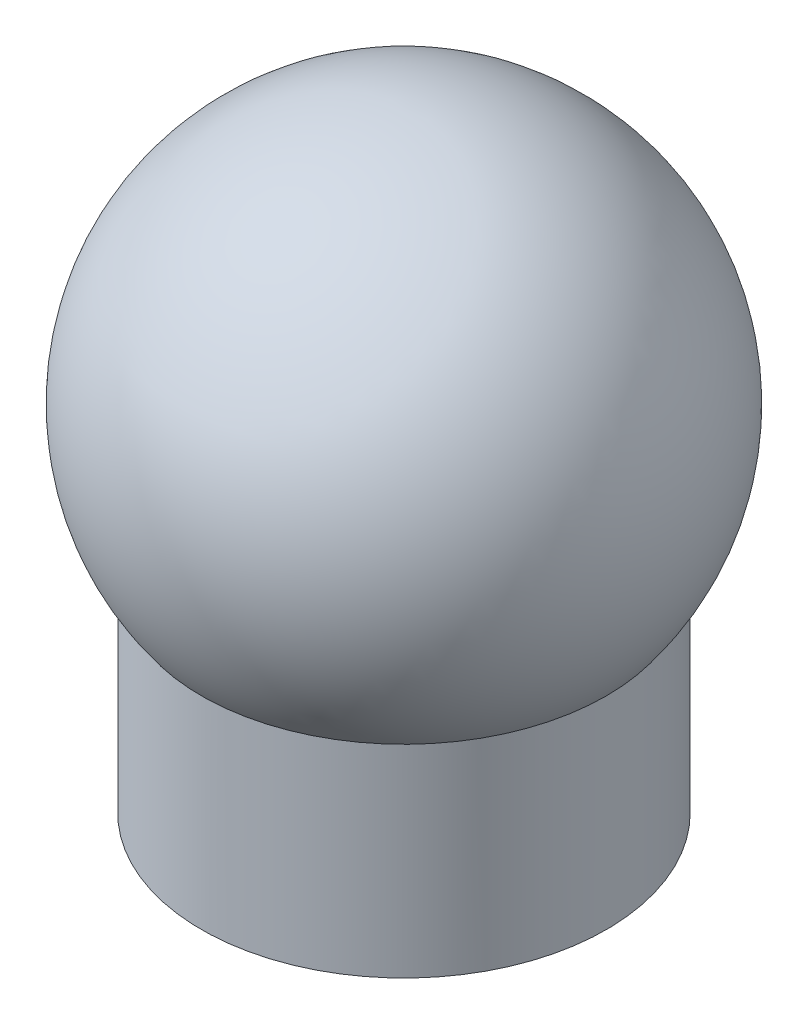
from build123d import *


with BuildPart() as part:
    # Sketch1 → Base-Revolve (revolve)
    with BuildSketch(Plane.XY, mode=Mode.PRIVATE) as base_revolve_sk:
        with BuildLine():
            Line((0, 0), (5.08, 0))
            Line((5.08, 0), (5.08, 5.08))
            ThreePointArc((5.08, 5.08), (5.679612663, 11.729806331), (0, 15.24))
            Line((0, 15.24), (0, 0))
        make_face()
    revolve(base_revolve_sk.sketch.rotate(Axis((0, 0, 0), (0, 1, 0)), 90), axis=Axis((0, 0, 0), (0, 1, 0)))


solid = part.part
